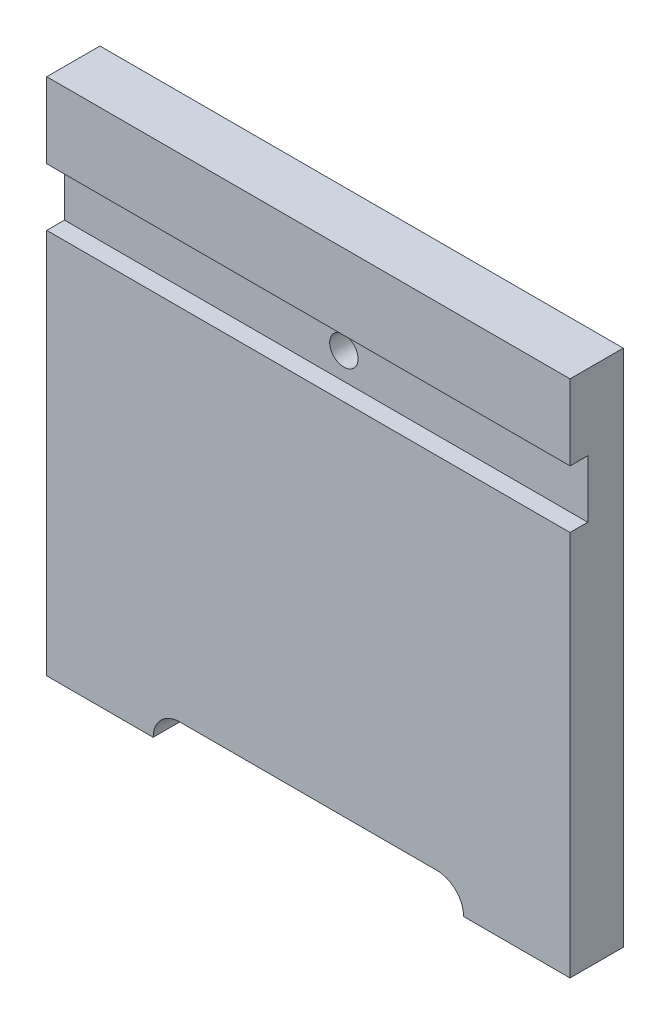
ISO-10303-21;
HEADER;
FILE_DESCRIPTION(('STEP AP214'),'2;1');
FILE_NAME('part.step','',(''),(''),'','','');
FILE_SCHEMA(('AUTOMOTIVE_DESIGN { 1 0 10303 214 1 1 1 1 }'));
ENDSEC;
DATA;
#1=APPLICATION_CONTEXT('core data for automotive mechanical design processes');
#2=APPLICATION_PROTOCOL_DEFINITION('international standard','automotive_design',2000,#1);
#3=PRODUCT_CONTEXT('',#1,'mechanical');
#4=PRODUCT('Part','Part','',(#3));
#5=PRODUCT_RELATED_PRODUCT_CATEGORY('part','',(#4));
#6=PRODUCT_DEFINITION_FORMATION('','',#4);
#7=PRODUCT_DEFINITION_CONTEXT('part definition',#1,'design');
#8=PRODUCT_DEFINITION('design','',#6,#7);
#9=PRODUCT_DEFINITION_SHAPE('','',#8);
#10=(LENGTH_UNIT() NAMED_UNIT(*) SI_UNIT(.MILLI.,.METRE.));
#11=(NAMED_UNIT(*) PLANE_ANGLE_UNIT() SI_UNIT($,.RADIAN.));
#12=(NAMED_UNIT(*) SI_UNIT($,.STERADIAN.) SOLID_ANGLE_UNIT());
#13=UNCERTAINTY_MEASURE_WITH_UNIT(LENGTH_MEASURE(1.E-05),#10,'distance_accuracy_value','');
#14=(GEOMETRIC_REPRESENTATION_CONTEXT(3) GLOBAL_UNCERTAINTY_ASSIGNED_CONTEXT((#13)) GLOBAL_UNIT_ASSIGNED_CONTEXT((#10,
#11,#12)) REPRESENTATION_CONTEXT('',''));
#15=CARTESIAN_POINT('',(0.,0.,0.));
#16=DIRECTION('',(0.,0.,1.));
#17=DIRECTION('',(1.,0.,0.));
#18=AXIS2_PLACEMENT_3D('',#15,#16,#17);
#19=CARTESIAN_POINT('',(-9.00000000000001,-40.,6.));
#20=DIRECTION('',(0.,0.,1.));
#21=DIRECTION('',(1.,0.,0.));
#22=AXIS2_PLACEMENT_3D('',#19,#20,#21);
#23=PLANE('',#22);
#24=DIRECTION('',(1.,0.,0.));
#25=VECTOR('',#24,1.);
#26=CARTESIAN_POINT('',(50.,3.5,6.));
#27=LINE('',#26,#25);
#28=CARTESIAN_POINT('',(-9.00000000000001,3.5,6.));
#29=VERTEX_POINT('',#28);
#30=CARTESIAN_POINT('',(50.,3.5,6.));
#31=VERTEX_POINT('',#30);
#32=EDGE_CURVE('E122',#29,#31,#27,.T.);
#33=ORIENTED_EDGE('',*,*,#32,.F.);
#34=DIRECTION('',(0.,-1.,0.));
#35=VECTOR('',#34,1.);
#36=CARTESIAN_POINT('',(-9.00000000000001,18.5,6.));
#37=LINE('',#36,#35);
#38=CARTESIAN_POINT('',(-9.00000000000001,-40.,6.));
#39=VERTEX_POINT('',#38);
#40=EDGE_CURVE('E140',#29,#39,#37,.T.);
#41=ORIENTED_EDGE('',*,*,#40,.T.);
#42=DIRECTION('',(1.,0.,0.));
#43=VECTOR('',#42,1.);
#44=CARTESIAN_POINT('',(-9.00000000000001,-40.,6.));
#45=LINE('',#44,#43);
#46=CARTESIAN_POINT('',(2.99999999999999,-40.,6.));
#47=VERTEX_POINT('',#46);
#48=EDGE_CURVE('E142',#39,#47,#45,.T.);
#49=ORIENTED_EDGE('',*,*,#48,.T.);
#50=CARTESIAN_POINT('',(5.99999999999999,-40.,6.));
#51=DIRECTION('',(0.,0.,1.));
#52=DIRECTION('',(1.,0.,0.));
#53=AXIS2_PLACEMENT_3D('',#50,#51,#52);
#54=CIRCLE('',#53,3.);
#55=CARTESIAN_POINT('',(5.99999999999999,-37.,6.));
#56=VERTEX_POINT('',#55);
#57=EDGE_CURVE('E35',#47,#56,#54,.F.);
#58=ORIENTED_EDGE('',*,*,#57,.T.);
#59=DIRECTION('',(-1.,0.,0.));
#60=VECTOR('',#59,1.);
#61=CARTESIAN_POINT('',(2.99999999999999,-37.,6.));
#62=LINE('',#61,#60);
#63=CARTESIAN_POINT('',(35.,-37.,6.));
#64=VERTEX_POINT('',#63);
#65=EDGE_CURVE('E175',#64,#56,#62,.T.);
#66=ORIENTED_EDGE('',*,*,#65,.F.);
#67=CARTESIAN_POINT('',(35.,-40.,6.));
#68=DIRECTION('',(0.,0.,1.));
#69=DIRECTION('',(1.,0.,0.));
#70=AXIS2_PLACEMENT_3D('',#67,#68,#69);
#71=CIRCLE('',#70,3.);
#72=CARTESIAN_POINT('',(38.,-40.,6.));
#73=VERTEX_POINT('',#72);
#74=EDGE_CURVE('E169',#64,#73,#71,.F.);
#75=ORIENTED_EDGE('',*,*,#74,.T.);
#76=CARTESIAN_POINT('',(50.,-40.,6.));
#77=VERTEX_POINT('',#76);
#78=EDGE_CURVE('E139',#73,#77,#45,.T.);
#79=ORIENTED_EDGE('',*,*,#78,.T.);
#80=DIRECTION('',(0.,1.,0.));
#81=VECTOR('',#80,1.);
#82=CARTESIAN_POINT('',(50.,18.5,6.));
#83=LINE('',#82,#81);
#84=EDGE_CURVE('E150',#77,#31,#83,.T.);
#85=ORIENTED_EDGE('',*,*,#84,.T.);
#86=EDGE_LOOP('',(#33,#41,#49,#58,#66,#75,#79,#85));
#87=FACE_BOUND('',#86,.T.);
#88=ADVANCED_FACE('F27',(#87),#23,.T.);
#89=CARTESIAN_POINT('',(-9.00000000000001,-40.,6.));
#90=DIRECTION('',(0.,1.,0.));
#91=DIRECTION('',(0.,0.,1.));
#92=AXIS2_PLACEMENT_3D('',#89,#90,#91);
#93=PLANE('',#92);
#94=DIRECTION('',(1.,0.,0.));
#95=VECTOR('',#94,1.);
#96=CARTESIAN_POINT('',(-9.00000000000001,-40.,0.));
#97=LINE('',#96,#95);
#98=CARTESIAN_POINT('',(-9.00000000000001,-40.,0.));
#99=VERTEX_POINT('',#98);
#100=CARTESIAN_POINT('',(2.99999999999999,-40.,0.));
#101=VERTEX_POINT('',#100);
#102=EDGE_CURVE('E193',#99,#101,#97,.T.);
#103=ORIENTED_EDGE('',*,*,#102,.T.);
#104=DIRECTION('',(0.,0.,1.));
#105=VECTOR('',#104,1.);
#106=CARTESIAN_POINT('',(2.99999999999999,-40.,0.));
#107=LINE('',#106,#105);
#108=EDGE_CURVE('E187',#101,#47,#107,.T.);
#109=ORIENTED_EDGE('',*,*,#108,.T.);
#110=ORIENTED_EDGE('',*,*,#48,.F.);
#111=DIRECTION('',(0.,0.,-1.));
#112=VECTOR('',#111,1.);
#113=CARTESIAN_POINT('',(-9.00000000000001,-40.,6.));
#114=LINE('',#113,#112);
#115=EDGE_CURVE('E162',#39,#99,#114,.T.);
#116=ORIENTED_EDGE('',*,*,#115,.T.);
#117=EDGE_LOOP('',(#103,#109,#110,#116));
#118=FACE_BOUND('',#117,.T.);
#119=ADVANCED_FACE('F195',(#118),#93,.F.);
#120=CARTESIAN_POINT('',(-9.00000000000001,18.5,6.));
#121=DIRECTION('',(1.,0.,0.));
#122=DIRECTION('',(0.,1.,0.));
#123=AXIS2_PLACEMENT_3D('',#120,#121,#122);
#124=PLANE('',#123);
#125=ORIENTED_EDGE('',*,*,#40,.F.);
#126=DIRECTION('',(0.,0.,1.));
#127=VECTOR('',#126,1.);
#128=CARTESIAN_POINT('',(-9.00000000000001,3.5,4.));
#129=LINE('',#128,#127);
#130=CARTESIAN_POINT('',(-9.00000000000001,3.5,4.));
#131=VERTEX_POINT('',#130);
#132=EDGE_CURVE('E133',#131,#29,#129,.T.);
#133=ORIENTED_EDGE('',*,*,#132,.F.);
#134=DIRECTION('',(0.,-1.,0.));
#135=VECTOR('',#134,1.);
#136=CARTESIAN_POINT('',(-9.00000000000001,10.,4.));
#137=LINE('',#136,#135);
#138=CARTESIAN_POINT('',(-9.00000000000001,10.,4.));
#139=VERTEX_POINT('',#138);
#140=EDGE_CURVE('E132',#139,#131,#137,.T.);
#141=ORIENTED_EDGE('',*,*,#140,.F.);
#142=DIRECTION('',(0.,0.,1.));
#143=VECTOR('',#142,1.);
#144=CARTESIAN_POINT('',(-9.00000000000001,10.,4.));
#145=LINE('',#144,#143);
#146=CARTESIAN_POINT('',(-9.00000000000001,10.,6.));
#147=VERTEX_POINT('',#146);
#148=EDGE_CURVE('E117',#139,#147,#145,.T.);
#149=ORIENTED_EDGE('',*,*,#148,.T.);
#150=CARTESIAN_POINT('',(-9.00000000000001,18.5,6.));
#151=VERTEX_POINT('',#150);
#152=EDGE_CURVE('E130',#151,#147,#37,.T.);
#153=ORIENTED_EDGE('',*,*,#152,.F.);
#154=DIRECTION('',(0.,0.,-1.));
#155=VECTOR('',#154,1.);
#156=CARTESIAN_POINT('',(-9.00000000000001,18.5,6.));
#157=LINE('',#156,#155);
#158=CARTESIAN_POINT('',(-9.00000000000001,18.5,0.));
#159=VERTEX_POINT('',#158);
#160=EDGE_CURVE('E154',#151,#159,#157,.T.);
#161=ORIENTED_EDGE('',*,*,#160,.T.);
#162=DIRECTION('',(0.,-1.,0.));
#163=VECTOR('',#162,1.);
#164=CARTESIAN_POINT('',(-9.00000000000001,18.5,0.));
#165=LINE('',#164,#163);
#166=EDGE_CURVE('E201',#159,#99,#165,.T.);
#167=ORIENTED_EDGE('',*,*,#166,.T.);
#168=ORIENTED_EDGE('',*,*,#115,.F.);
#169=EDGE_LOOP('',(#125,#133,#141,#149,#153,#161,#167,#168));
#170=FACE_BOUND('',#169,.T.);
#171=ADVANCED_FACE('F29',(#170),#124,.F.);
#172=ORIENTED_EDGE('',*,*,#78,.F.);
#173=DIRECTION('',(0.,0.,1.));
#174=VECTOR('',#173,1.);
#175=CARTESIAN_POINT('',(38.,-40.,0.));
#176=LINE('',#175,#174);
#177=CARTESIAN_POINT('',(38.,-40.,0.));
#178=VERTEX_POINT('',#177);
#179=EDGE_CURVE('E204',#178,#73,#176,.T.);
#180=ORIENTED_EDGE('',*,*,#179,.F.);
#181=CARTESIAN_POINT('',(50.,-40.,0.));
#182=VERTEX_POINT('',#181);
#183=EDGE_CURVE('E199',#178,#182,#97,.T.);
#184=ORIENTED_EDGE('',*,*,#183,.T.);
#185=DIRECTION('',(0.,0.,-1.));
#186=VECTOR('',#185,1.);
#187=CARTESIAN_POINT('',(50.,-40.,6.));
#188=LINE('',#187,#186);
#189=EDGE_CURVE('E159',#77,#182,#188,.T.);
#190=ORIENTED_EDGE('',*,*,#189,.F.);
#191=EDGE_LOOP('',(#172,#180,#184,#190));
#192=FACE_BOUND('',#191,.T.);
#193=ADVANCED_FACE('F250',(#192),#93,.F.);
#194=CARTESIAN_POINT('',(50.,18.5,6.));
#195=DIRECTION('',(-1.,0.,0.));
#196=DIRECTION('',(0.,-1.,0.));
#197=AXIS2_PLACEMENT_3D('',#194,#195,#196);
#198=PLANE('',#197);
#199=DIRECTION('',(0.,1.,0.));
#200=VECTOR('',#199,1.);
#201=CARTESIAN_POINT('',(50.,10.,4.));
#202=LINE('',#201,#200);
#203=CARTESIAN_POINT('',(50.,3.5,4.));
#204=VERTEX_POINT('',#203);
#205=CARTESIAN_POINT('',(50.,10.,4.));
#206=VERTEX_POINT('',#205);
#207=EDGE_CURVE('E219',#204,#206,#202,.T.);
#208=ORIENTED_EDGE('',*,*,#207,.F.);
#209=DIRECTION('',(0.,0.,1.));
#210=VECTOR('',#209,1.);
#211=CARTESIAN_POINT('',(50.,3.5,4.));
#212=LINE('',#211,#210);
#213=EDGE_CURVE('E183',#204,#31,#212,.T.);
#214=ORIENTED_EDGE('',*,*,#213,.T.);
#215=ORIENTED_EDGE('',*,*,#84,.F.);
#216=ORIENTED_EDGE('',*,*,#189,.T.);
#217=DIRECTION('',(0.,1.,0.));
#218=VECTOR('',#217,1.);
#219=CARTESIAN_POINT('',(50.,18.5,0.));
#220=LINE('',#219,#218);
#221=CARTESIAN_POINT('',(50.,18.5,0.));
#222=VERTEX_POINT('',#221);
#223=EDGE_CURVE('E198',#182,#222,#220,.T.);
#224=ORIENTED_EDGE('',*,*,#223,.T.);
#225=DIRECTION('',(0.,0.,-1.));
#226=VECTOR('',#225,1.);
#227=CARTESIAN_POINT('',(50.,18.5,6.));
#228=LINE('',#227,#226);
#229=CARTESIAN_POINT('',(50.,18.5,6.));
#230=VERTEX_POINT('',#229);
#231=EDGE_CURVE('E156',#230,#222,#228,.T.);
#232=ORIENTED_EDGE('',*,*,#231,.F.);
#233=CARTESIAN_POINT('',(50.,10.,6.));
#234=VERTEX_POINT('',#233);
#235=EDGE_CURVE('E149',#234,#230,#83,.T.);
#236=ORIENTED_EDGE('',*,*,#235,.F.);
#237=DIRECTION('',(0.,0.,1.));
#238=VECTOR('',#237,1.);
#239=CARTESIAN_POINT('',(50.,10.,4.));
#240=LINE('',#239,#238);
#241=EDGE_CURVE('E42',#206,#234,#240,.T.);
#242=ORIENTED_EDGE('',*,*,#241,.F.);
#243=EDGE_LOOP('',(#208,#214,#215,#216,#224,#232,#236,#242));
#244=FACE_BOUND('',#243,.T.);
#245=ADVANCED_FACE('F238',(#244),#198,.F.);
#246=CARTESIAN_POINT('',(-9.00000000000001,18.5,6.));
#247=DIRECTION('',(0.,-1.,0.));
#248=DIRECTION('',(0.,0.,-1.));
#249=AXIS2_PLACEMENT_3D('',#246,#247,#248);
#250=PLANE('',#249);
#251=DIRECTION('',(-1.,0.,0.));
#252=VECTOR('',#251,1.);
#253=CARTESIAN_POINT('',(-9.00000000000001,18.5,0.));
#254=LINE('',#253,#252);
#255=EDGE_CURVE('E144',#222,#159,#254,.T.);
#256=ORIENTED_EDGE('',*,*,#255,.T.);
#257=ORIENTED_EDGE('',*,*,#160,.F.);
#258=DIRECTION('',(-1.,0.,0.));
#259=VECTOR('',#258,1.);
#260=CARTESIAN_POINT('',(-9.00000000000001,18.5,6.));
#261=LINE('',#260,#259);
#262=EDGE_CURVE('E137',#230,#151,#261,.T.);
#263=ORIENTED_EDGE('',*,*,#262,.F.);
#264=ORIENTED_EDGE('',*,*,#231,.T.);
#265=EDGE_LOOP('',(#256,#257,#263,#264));
#266=FACE_BOUND('',#265,.T.);
#267=ADVANCED_FACE('F243',(#266),#250,.F.);
#268=DIRECTION('',(-1.,0.,0.));
#269=VECTOR('',#268,1.);
#270=CARTESIAN_POINT('',(50.,10.,6.));
#271=LINE('',#270,#269);
#272=EDGE_CURVE('E114',#234,#147,#271,.T.);
#273=ORIENTED_EDGE('',*,*,#272,.F.);
#274=ORIENTED_EDGE('',*,*,#235,.T.);
#275=ORIENTED_EDGE('',*,*,#262,.T.);
#276=ORIENTED_EDGE('',*,*,#152,.T.);
#277=EDGE_LOOP('',(#273,#274,#275,#276));
#278=FACE_BOUND('',#277,.T.);
#279=ADVANCED_FACE('F135',(#278),#23,.T.);
#280=CARTESIAN_POINT('',(-9.00000000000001,-40.,0.));
#281=DIRECTION('',(0.,0.,1.));
#282=DIRECTION('',(1.,0.,0.));
#283=AXIS2_PLACEMENT_3D('',#280,#281,#282);
#284=PLANE('',#283);
#285=CARTESIAN_POINT('',(22.5,6.5,0.));
#286=DIRECTION('',(0.,0.,1.));
#287=DIRECTION('',(1.,0.,0.));
#288=AXIS2_PLACEMENT_3D('',#285,#286,#287);
#289=CIRCLE('',#288,1.6);
#290=CARTESIAN_POINT('',(24.1,6.5,0.));
#291=VERTEX_POINT('',#290);
#292=EDGE_CURVE('E123',#291,#291,#289,.T.);
#293=ORIENTED_EDGE('',*,*,#292,.T.);
#294=EDGE_LOOP('',(#293));
#295=FACE_BOUND('',#294,.T.);
#296=ORIENTED_EDGE('',*,*,#183,.F.);
#297=CARTESIAN_POINT('',(35.,-40.,0.));
#298=DIRECTION('',(0.,0.,1.));
#299=DIRECTION('',(1.,0.,0.));
#300=AXIS2_PLACEMENT_3D('',#297,#298,#299);
#301=CIRCLE('',#300,3.);
#302=CARTESIAN_POINT('',(35.,-37.,0.));
#303=VERTEX_POINT('',#302);
#304=EDGE_CURVE('E171',#178,#303,#301,.T.);
#305=ORIENTED_EDGE('',*,*,#304,.T.);
#306=DIRECTION('',(-1.,0.,0.));
#307=VECTOR('',#306,1.);
#308=CARTESIAN_POINT('',(2.99999999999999,-37.,0.));
#309=LINE('',#308,#307);
#310=CARTESIAN_POINT('',(5.99999999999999,-37.,0.));
#311=VERTEX_POINT('',#310);
#312=EDGE_CURVE('E182',#303,#311,#309,.T.);
#313=ORIENTED_EDGE('',*,*,#312,.T.);
#314=CARTESIAN_POINT('',(5.99999999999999,-40.,0.));
#315=DIRECTION('',(0.,0.,1.));
#316=DIRECTION('',(1.,0.,0.));
#317=AXIS2_PLACEMENT_3D('',#314,#315,#316);
#318=CIRCLE('',#317,3.);
#319=EDGE_CURVE('E11',#311,#101,#318,.T.);
#320=ORIENTED_EDGE('',*,*,#319,.T.);
#321=ORIENTED_EDGE('',*,*,#102,.F.);
#322=ORIENTED_EDGE('',*,*,#166,.F.);
#323=ORIENTED_EDGE('',*,*,#255,.F.);
#324=ORIENTED_EDGE('',*,*,#223,.F.);
#325=EDGE_LOOP('',(#296,#305,#313,#320,#321,#322,#323,#324));
#326=FACE_BOUND('',#325,.T.);
#327=ADVANCED_FACE('F191',(#295,#326),#284,.F.);
#328=CARTESIAN_POINT('',(2.99999999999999,-37.,0.));
#329=DIRECTION('',(0.,1.,0.));
#330=DIRECTION('',(0.,0.,1.));
#331=AXIS2_PLACEMENT_3D('',#328,#329,#330);
#332=PLANE('',#331);
#333=ORIENTED_EDGE('',*,*,#312,.F.);
#334=DIRECTION('',(0.,0.,1.));
#335=VECTOR('',#334,1.);
#336=CARTESIAN_POINT('',(35.,-37.,6.));
#337=LINE('',#336,#335);
#338=EDGE_CURVE('E166',#303,#64,#337,.T.);
#339=ORIENTED_EDGE('',*,*,#338,.T.);
#340=ORIENTED_EDGE('',*,*,#65,.T.);
#341=DIRECTION('',(0.,0.,1.));
#342=VECTOR('',#341,1.);
#343=CARTESIAN_POINT('',(5.99999999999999,-37.,0.));
#344=LINE('',#343,#342);
#345=EDGE_CURVE('E50',#56,#311,#344,.F.);
#346=ORIENTED_EDGE('',*,*,#345,.T.);
#347=EDGE_LOOP('',(#333,#339,#340,#346));
#348=FACE_BOUND('',#347,.T.);
#349=ADVANCED_FACE('F180',(#348),#332,.F.);
#350=CARTESIAN_POINT('',(35.,-40.,0.));
#351=DIRECTION('',(0.,0.,-1.));
#352=DIRECTION('',(-1.,0.,0.));
#353=AXIS2_PLACEMENT_3D('',#350,#351,#352);
#354=CYLINDRICAL_SURFACE('',#353,3.);
#355=ORIENTED_EDGE('',*,*,#304,.F.);
#356=ORIENTED_EDGE('',*,*,#179,.T.);
#357=ORIENTED_EDGE('',*,*,#74,.F.);
#358=ORIENTED_EDGE('',*,*,#338,.F.);
#359=EDGE_LOOP('',(#355,#356,#357,#358));
#360=FACE_BOUND('',#359,.T.);
#361=ADVANCED_FACE('F248',(#360),#354,.F.);
#362=CARTESIAN_POINT('',(5.99999999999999,-40.,0.));
#363=DIRECTION('',(0.,0.,-1.));
#364=DIRECTION('',(-1.,0.,0.));
#365=AXIS2_PLACEMENT_3D('',#362,#363,#364);
#366=CYLINDRICAL_SURFACE('',#365,3.);
#367=ORIENTED_EDGE('',*,*,#319,.F.);
#368=ORIENTED_EDGE('',*,*,#345,.F.);
#369=ORIENTED_EDGE('',*,*,#57,.F.);
#370=ORIENTED_EDGE('',*,*,#108,.F.);
#371=EDGE_LOOP('',(#367,#368,#369,#370));
#372=FACE_BOUND('',#371,.T.);
#373=ADVANCED_FACE('F186',(#372),#366,.F.);
#374=CARTESIAN_POINT('',(50.,3.5,4.));
#375=DIRECTION('',(0.,-1.,0.));
#376=DIRECTION('',(1.,0.,0.));
#377=AXIS2_PLACEMENT_3D('',#374,#375,#376);
#378=PLANE('',#377);
#379=ORIENTED_EDGE('',*,*,#32,.T.);
#380=ORIENTED_EDGE('',*,*,#213,.F.);
#381=DIRECTION('',(1.,0.,0.));
#382=VECTOR('',#381,1.);
#383=CARTESIAN_POINT('',(50.,3.5,4.));
#384=LINE('',#383,#382);
#385=EDGE_CURVE('E209',#131,#204,#384,.T.);
#386=ORIENTED_EDGE('',*,*,#385,.F.);
#387=ORIENTED_EDGE('',*,*,#132,.T.);
#388=EDGE_LOOP('',(#379,#380,#386,#387));
#389=FACE_BOUND('',#388,.T.);
#390=ADVANCED_FACE('F253',(#389),#378,.F.);
#391=CARTESIAN_POINT('',(50.,10.,4.));
#392=DIRECTION('',(0.,1.,0.));
#393=DIRECTION('',(-1.,0.,0.));
#394=AXIS2_PLACEMENT_3D('',#391,#392,#393);
#395=PLANE('',#394);
#396=ORIENTED_EDGE('',*,*,#272,.T.);
#397=ORIENTED_EDGE('',*,*,#148,.F.);
#398=DIRECTION('',(-1.,0.,0.));
#399=VECTOR('',#398,1.);
#400=CARTESIAN_POINT('',(50.,10.,4.));
#401=LINE('',#400,#399);
#402=EDGE_CURVE('E217',#206,#139,#401,.T.);
#403=ORIENTED_EDGE('',*,*,#402,.F.);
#404=ORIENTED_EDGE('',*,*,#241,.T.);
#405=EDGE_LOOP('',(#396,#397,#403,#404));
#406=FACE_BOUND('',#405,.T.);
#407=ADVANCED_FACE('F116',(#406),#395,.F.);
#408=CARTESIAN_POINT('',(50.,3.5,4.));
#409=DIRECTION('',(0.,0.,-1.));
#410=DIRECTION('',(-1.,0.,0.));
#411=AXIS2_PLACEMENT_3D('',#408,#409,#410);
#412=PLANE('',#411);
#413=CARTESIAN_POINT('',(22.5,6.5,4.));
#414=DIRECTION('',(0.,0.,1.));
#415=DIRECTION('',(1.,0.,0.));
#416=AXIS2_PLACEMENT_3D('',#413,#414,#415);
#417=CIRCLE('',#416,1.6);
#418=CARTESIAN_POINT('',(24.1,6.5,4.));
#419=VERTEX_POINT('',#418);
#420=EDGE_CURVE('E225',#419,#419,#417,.T.);
#421=ORIENTED_EDGE('',*,*,#420,.F.);
#422=EDGE_LOOP('',(#421));
#423=FACE_BOUND('',#422,.T.);
#424=ORIENTED_EDGE('',*,*,#207,.T.);
#425=ORIENTED_EDGE('',*,*,#402,.T.);
#426=ORIENTED_EDGE('',*,*,#140,.T.);
#427=ORIENTED_EDGE('',*,*,#385,.T.);
#428=EDGE_LOOP('',(#424,#425,#426,#427));
#429=FACE_BOUND('',#428,.T.);
#430=ADVANCED_FACE('F231',(#423,#429),#412,.F.);
#431=CARTESIAN_POINT('',(22.5,6.5,0.));
#432=DIRECTION('',(0.,0.,1.));
#433=DIRECTION('',(1.,0.,0.));
#434=AXIS2_PLACEMENT_3D('',#431,#432,#433);
#435=CYLINDRICAL_SURFACE('',#434,1.6);
#436=ORIENTED_EDGE('',*,*,#292,.F.);
#437=EDGE_LOOP('',(#436));
#438=FACE_BOUND('',#437,.T.);
#439=ORIENTED_EDGE('',*,*,#420,.T.);
#440=EDGE_LOOP('',(#439));
#441=FACE_BOUND('',#440,.T.);
#442=ADVANCED_FACE('F229',(#438,#441),#435,.F.);
#443=CLOSED_SHELL('',(#88,#119,#171,#193,#245,#267,#279,#327,#349,#361,#373,#390,#407,#430,#442));
#444=MANIFOLD_SOLID_BREP('B2',#443);
#445=ADVANCED_BREP_SHAPE_REPRESENTATION('',(#18,#444),#14);
#446=SHAPE_DEFINITION_REPRESENTATION(#9,#445);
ENDSEC;
END-ISO-10303-21;
